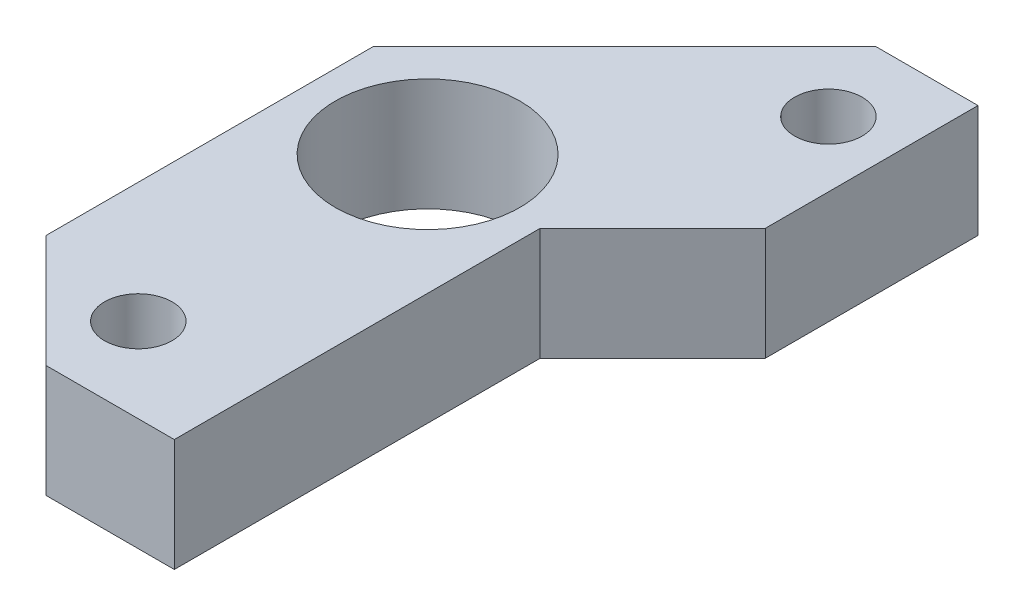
ISO-10303-21;
HEADER;
FILE_DESCRIPTION(('STEP AP214'),'2;1');
FILE_NAME('part.step','',(''),(''),'','','');
FILE_SCHEMA(('AUTOMOTIVE_DESIGN { 1 0 10303 214 1 1 1 1 }'));
ENDSEC;
DATA;
#1=APPLICATION_CONTEXT('core data for automotive mechanical design processes');
#2=APPLICATION_PROTOCOL_DEFINITION('international standard','automotive_design',2000,#1);
#3=PRODUCT_CONTEXT('',#1,'mechanical');
#4=PRODUCT('Part','Part','',(#3));
#5=PRODUCT_RELATED_PRODUCT_CATEGORY('part','',(#4));
#6=PRODUCT_DEFINITION_FORMATION('','',#4);
#7=PRODUCT_DEFINITION_CONTEXT('part definition',#1,'design');
#8=PRODUCT_DEFINITION('design','',#6,#7);
#9=PRODUCT_DEFINITION_SHAPE('','',#8);
#10=(LENGTH_UNIT() NAMED_UNIT(*) SI_UNIT(.MILLI.,.METRE.));
#11=(NAMED_UNIT(*) PLANE_ANGLE_UNIT() SI_UNIT($,.RADIAN.));
#12=(NAMED_UNIT(*) SI_UNIT($,.STERADIAN.) SOLID_ANGLE_UNIT());
#13=UNCERTAINTY_MEASURE_WITH_UNIT(LENGTH_MEASURE(1.E-05),#10,'distance_accuracy_value','');
#14=(GEOMETRIC_REPRESENTATION_CONTEXT(3) GLOBAL_UNCERTAINTY_ASSIGNED_CONTEXT((#13)) GLOBAL_UNIT_ASSIGNED_CONTEXT((#10,
#11,#12)) REPRESENTATION_CONTEXT('',''));
#15=CARTESIAN_POINT('',(0.,0.,0.));
#16=DIRECTION('',(0.,0.,1.));
#17=DIRECTION('',(1.,0.,0.));
#18=AXIS2_PLACEMENT_3D('',#15,#16,#17);
#19=CARTESIAN_POINT('',(0.,4.,0.));
#20=DIRECTION('',(0.,1.,0.));
#21=DIRECTION('',(0.,0.,1.));
#22=AXIS2_PLACEMENT_3D('',#19,#20,#21);
#23=PLANE('',#22);
#24=CARTESIAN_POINT('',(43.5,4.,10.28));
#25=DIRECTION('',(0.,1.,0.));
#26=DIRECTION('',(0.,0.,1.));
#27=AXIS2_PLACEMENT_3D('',#24,#25,#26);
#28=CIRCLE('',#27,1.2);
#29=CARTESIAN_POINT('',(43.5,4.,11.48));
#30=VERTEX_POINT('',#29);
#31=EDGE_CURVE('E182',#30,#30,#28,.T.);
#32=ORIENTED_EDGE('',*,*,#31,.F.);
#33=EDGE_LOOP('',(#32));
#34=FACE_BOUND('',#33,.T.);
#35=DIRECTION('',(0.,0.,-1.));
#36=VECTOR('',#35,1.);
#37=CARTESIAN_POINT('',(47.78,4.,0.280000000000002));
#38=LINE('',#37,#36);
#39=CARTESIAN_POINT('',(47.78,4.,13.28));
#40=VERTEX_POINT('',#39);
#41=CARTESIAN_POINT('',(47.78,4.,0.280000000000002));
#42=VERTEX_POINT('',#41);
#43=EDGE_CURVE('E145',#40,#42,#38,.T.);
#44=ORIENTED_EDGE('',*,*,#43,.T.);
#45=DIRECTION('',(0.707106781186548,0.,-0.707106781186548));
#46=VECTOR('',#45,1.);
#47=CARTESIAN_POINT('',(47.78,4.,0.280000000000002));
#48=LINE('',#47,#46);
#49=CARTESIAN_POINT('',(51.78,4.,-3.71999999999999));
#50=VERTEX_POINT('',#49);
#51=EDGE_CURVE('E93',#42,#50,#48,.T.);
#52=ORIENTED_EDGE('',*,*,#51,.T.);
#53=DIRECTION('',(0.,0.,-1.));
#54=VECTOR('',#53,1.);
#55=CARTESIAN_POINT('',(51.78,4.,-11.28));
#56=LINE('',#55,#54);
#57=CARTESIAN_POINT('',(51.78,4.,-11.28));
#58=VERTEX_POINT('',#57);
#59=EDGE_CURVE('E160',#50,#58,#56,.T.);
#60=ORIENTED_EDGE('',*,*,#59,.T.);
#61=DIRECTION('',(-1.,0.,0.));
#62=VECTOR('',#61,1.);
#63=CARTESIAN_POINT('',(48.1467711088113,4.,-11.28));
#64=LINE('',#63,#62);
#65=CARTESIAN_POINT('',(48.1467711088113,4.,-11.28));
#66=VERTEX_POINT('',#65);
#67=EDGE_CURVE('E173',#58,#66,#64,.T.);
#68=ORIENTED_EDGE('',*,*,#67,.T.);
#69=DIRECTION('',(-0.707106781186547,0.,0.707106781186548));
#70=VECTOR('',#69,1.);
#71=CARTESIAN_POINT('',(39.22,4.,-2.3532288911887));
#72=LINE('',#71,#70);
#73=CARTESIAN_POINT('',(39.22,4.,-2.3532288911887));
#74=VERTEX_POINT('',#73);
#75=EDGE_CURVE('E112',#66,#74,#72,.T.);
#76=ORIENTED_EDGE('',*,*,#75,.T.);
#77=DIRECTION('',(0.,0.,1.));
#78=VECTOR('',#77,1.);
#79=CARTESIAN_POINT('',(39.22,4.,9.28000000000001));
#80=LINE('',#79,#78);
#81=CARTESIAN_POINT('',(39.22,4.,9.28000000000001));
#82=VERTEX_POINT('',#81);
#83=EDGE_CURVE('E106',#74,#82,#80,.T.);
#84=ORIENTED_EDGE('',*,*,#83,.T.);
#85=DIRECTION('',(0.707106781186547,0.,0.707106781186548));
#86=VECTOR('',#85,1.);
#87=CARTESIAN_POINT('',(43.22,4.,13.28));
#88=LINE('',#87,#86);
#89=CARTESIAN_POINT('',(43.22,4.,13.28));
#90=VERTEX_POINT('',#89);
#91=EDGE_CURVE('E110',#82,#90,#88,.T.);
#92=ORIENTED_EDGE('',*,*,#91,.T.);
#93=DIRECTION('',(1.,0.,0.));
#94=VECTOR('',#93,1.);
#95=CARTESIAN_POINT('',(43.22,4.,13.28));
#96=LINE('',#95,#94);
#97=EDGE_CURVE('E50',#90,#40,#96,.T.);
#98=ORIENTED_EDGE('',*,*,#97,.T.);
#99=EDGE_LOOP('',(#44,#52,#60,#68,#76,#84,#92,#98));
#100=FACE_BOUND('',#99,.T.);
#101=CARTESIAN_POINT('',(43.5,4.,0.));
#102=DIRECTION('',(0.,1.,0.));
#103=DIRECTION('',(0.,0.,1.));
#104=AXIS2_PLACEMENT_3D('',#101,#102,#103);
#105=CIRCLE('',#104,3.28000000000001);
#106=CARTESIAN_POINT('',(43.5,4.,3.28));
#107=VERTEX_POINT('',#106);
#108=EDGE_CURVE('E134',#107,#107,#105,.T.);
#109=ORIENTED_EDGE('',*,*,#108,.F.);
#110=EDGE_LOOP('',(#109));
#111=FACE_BOUND('',#110,.T.);
#112=CARTESIAN_POINT('',(49.4633855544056,4.,-8.28000000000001));
#113=DIRECTION('',(0.,1.,0.));
#114=DIRECTION('',(0.,0.,1.));
#115=AXIS2_PLACEMENT_3D('',#112,#113,#114);
#116=CIRCLE('',#115,1.2);
#117=CARTESIAN_POINT('',(49.4633855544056,4.,-7.08000000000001));
#118=VERTEX_POINT('',#117);
#119=EDGE_CURVE('E188',#118,#118,#116,.T.);
#120=ORIENTED_EDGE('',*,*,#119,.F.);
#121=EDGE_LOOP('',(#120));
#122=FACE_BOUND('',#121,.T.);
#123=ADVANCED_FACE('F33',(#34,#100,#111,#122),#23,.T.);
#124=CARTESIAN_POINT('',(0.,0.,0.));
#125=DIRECTION('',(0.,1.,0.));
#126=DIRECTION('',(0.,0.,1.));
#127=AXIS2_PLACEMENT_3D('',#124,#125,#126);
#128=PLANE('',#127);
#129=CARTESIAN_POINT('',(43.5,0.,10.28));
#130=DIRECTION('',(0.,1.,0.));
#131=DIRECTION('',(0.,0.,1.));
#132=AXIS2_PLACEMENT_3D('',#129,#130,#131);
#133=CIRCLE('',#132,1.2);
#134=CARTESIAN_POINT('',(43.5,0.,11.48));
#135=VERTEX_POINT('',#134);
#136=EDGE_CURVE('E185',#135,#135,#133,.T.);
#137=ORIENTED_EDGE('',*,*,#136,.T.);
#138=EDGE_LOOP('',(#137));
#139=FACE_BOUND('',#138,.T.);
#140=DIRECTION('',(0.,0.,-1.));
#141=VECTOR('',#140,1.);
#142=CARTESIAN_POINT('',(47.78,0.,0.280000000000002));
#143=LINE('',#142,#141);
#144=CARTESIAN_POINT('',(47.78,0.,13.28));
#145=VERTEX_POINT('',#144);
#146=CARTESIAN_POINT('',(47.78,0.,0.280000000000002));
#147=VERTEX_POINT('',#146);
#148=EDGE_CURVE('E130',#145,#147,#143,.T.);
#149=ORIENTED_EDGE('',*,*,#148,.F.);
#150=DIRECTION('',(1.,0.,0.));
#151=VECTOR('',#150,1.);
#152=CARTESIAN_POINT('',(43.22,0.,13.28));
#153=LINE('',#152,#151);
#154=CARTESIAN_POINT('',(43.22,0.,13.28));
#155=VERTEX_POINT('',#154);
#156=EDGE_CURVE('E85',#155,#145,#153,.T.);
#157=ORIENTED_EDGE('',*,*,#156,.F.);
#158=DIRECTION('',(0.707106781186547,0.,0.707106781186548));
#159=VECTOR('',#158,1.);
#160=CARTESIAN_POINT('',(43.22,0.,13.28));
#161=LINE('',#160,#159);
#162=CARTESIAN_POINT('',(39.22,0.,9.28000000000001));
#163=VERTEX_POINT('',#162);
#164=EDGE_CURVE('E79',#163,#155,#161,.T.);
#165=ORIENTED_EDGE('',*,*,#164,.F.);
#166=DIRECTION('',(0.,0.,1.));
#167=VECTOR('',#166,1.);
#168=CARTESIAN_POINT('',(39.22,0.,9.28000000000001));
#169=LINE('',#168,#167);
#170=CARTESIAN_POINT('',(39.22,0.,-2.3532288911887));
#171=VERTEX_POINT('',#170);
#172=EDGE_CURVE('E120',#171,#163,#169,.T.);
#173=ORIENTED_EDGE('',*,*,#172,.F.);
#174=DIRECTION('',(-0.707106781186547,0.,0.707106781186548));
#175=VECTOR('',#174,1.);
#176=CARTESIAN_POINT('',(39.22,0.,-2.3532288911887));
#177=LINE('',#176,#175);
#178=CARTESIAN_POINT('',(48.1467711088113,0.,-11.28));
#179=VERTEX_POINT('',#178);
#180=EDGE_CURVE('E140',#179,#171,#177,.T.);
#181=ORIENTED_EDGE('',*,*,#180,.F.);
#182=DIRECTION('',(-1.,0.,0.));
#183=VECTOR('',#182,1.);
#184=CARTESIAN_POINT('',(48.1467711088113,0.,-11.28));
#185=LINE('',#184,#183);
#186=CARTESIAN_POINT('',(51.78,0.,-11.28));
#187=VERTEX_POINT('',#186);
#188=EDGE_CURVE('E138',#187,#179,#185,.T.);
#189=ORIENTED_EDGE('',*,*,#188,.F.);
#190=DIRECTION('',(0.,0.,-1.));
#191=VECTOR('',#190,1.);
#192=CARTESIAN_POINT('',(51.78,0.,-11.28));
#193=LINE('',#192,#191);
#194=CARTESIAN_POINT('',(51.78,0.,-3.71999999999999));
#195=VERTEX_POINT('',#194);
#196=EDGE_CURVE('E136',#195,#187,#193,.T.);
#197=ORIENTED_EDGE('',*,*,#196,.F.);
#198=DIRECTION('',(0.707106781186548,0.,-0.707106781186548));
#199=VECTOR('',#198,1.);
#200=CARTESIAN_POINT('',(47.78,0.,0.280000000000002));
#201=LINE('',#200,#199);
#202=EDGE_CURVE('E133',#147,#195,#201,.T.);
#203=ORIENTED_EDGE('',*,*,#202,.F.);
#204=EDGE_LOOP('',(#149,#157,#165,#173,#181,#189,#197,#203));
#205=FACE_BOUND('',#204,.T.);
#206=CARTESIAN_POINT('',(43.5,0.,0.));
#207=DIRECTION('',(0.,1.,0.));
#208=DIRECTION('',(0.,0.,1.));
#209=AXIS2_PLACEMENT_3D('',#206,#207,#208);
#210=CIRCLE('',#209,3.28000000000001);
#211=CARTESIAN_POINT('',(43.5,0.,3.28));
#212=VERTEX_POINT('',#211);
#213=EDGE_CURVE('E179',#212,#212,#210,.T.);
#214=ORIENTED_EDGE('',*,*,#213,.T.);
#215=EDGE_LOOP('',(#214));
#216=FACE_BOUND('',#215,.T.);
#217=CARTESIAN_POINT('',(49.4633855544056,0.,-8.28000000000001));
#218=DIRECTION('',(0.,1.,0.));
#219=DIRECTION('',(0.,0.,1.));
#220=AXIS2_PLACEMENT_3D('',#217,#218,#219);
#221=CIRCLE('',#220,1.2);
#222=CARTESIAN_POINT('',(49.4633855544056,0.,-7.08000000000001));
#223=VERTEX_POINT('',#222);
#224=EDGE_CURVE('E191',#223,#223,#221,.T.);
#225=ORIENTED_EDGE('',*,*,#224,.T.);
#226=EDGE_LOOP('',(#225));
#227=FACE_BOUND('',#226,.T.);
#228=ADVANCED_FACE('F164',(#139,#205,#216,#227),#128,.F.);
#229=CARTESIAN_POINT('',(47.78,4.,0.280000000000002));
#230=DIRECTION('',(-1.,0.,0.));
#231=DIRECTION('',(0.,0.,1.));
#232=AXIS2_PLACEMENT_3D('',#229,#230,#231);
#233=PLANE('',#232);
#234=ORIENTED_EDGE('',*,*,#148,.T.);
#235=DIRECTION('',(0.,-1.,0.));
#236=VECTOR('',#235,1.);
#237=CARTESIAN_POINT('',(47.78,4.,0.280000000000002));
#238=LINE('',#237,#236);
#239=EDGE_CURVE('E11',#42,#147,#238,.T.);
#240=ORIENTED_EDGE('',*,*,#239,.F.);
#241=ORIENTED_EDGE('',*,*,#43,.F.);
#242=DIRECTION('',(0.,-1.,0.));
#243=VECTOR('',#242,1.);
#244=CARTESIAN_POINT('',(47.78,4.,13.28));
#245=LINE('',#244,#243);
#246=EDGE_CURVE('E126',#40,#145,#245,.T.);
#247=ORIENTED_EDGE('',*,*,#246,.T.);
#248=EDGE_LOOP('',(#234,#240,#241,#247));
#249=FACE_BOUND('',#248,.T.);
#250=ADVANCED_FACE('F35',(#249),#233,.F.);
#251=CARTESIAN_POINT('',(47.78,4.,0.280000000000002));
#252=DIRECTION('',(-0.707106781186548,0.,-0.707106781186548));
#253=DIRECTION('',(-0.707106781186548,0.,0.707106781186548));
#254=AXIS2_PLACEMENT_3D('',#251,#252,#253);
#255=PLANE('',#254);
#256=ORIENTED_EDGE('',*,*,#202,.T.);
#257=DIRECTION('',(0.,-1.,0.));
#258=VECTOR('',#257,1.);
#259=CARTESIAN_POINT('',(51.78,4.,-3.71999999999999));
#260=LINE('',#259,#258);
#261=EDGE_CURVE('E42',#50,#195,#260,.T.);
#262=ORIENTED_EDGE('',*,*,#261,.F.);
#263=ORIENTED_EDGE('',*,*,#51,.F.);
#264=ORIENTED_EDGE('',*,*,#239,.T.);
#265=EDGE_LOOP('',(#256,#262,#263,#264));
#266=FACE_BOUND('',#265,.T.);
#267=ADVANCED_FACE('F225',(#266),#255,.F.);
#268=CARTESIAN_POINT('',(51.78,4.,-11.28));
#269=DIRECTION('',(-1.,0.,0.));
#270=DIRECTION('',(0.,0.,1.));
#271=AXIS2_PLACEMENT_3D('',#268,#269,#270);
#272=PLANE('',#271);
#273=ORIENTED_EDGE('',*,*,#196,.T.);
#274=DIRECTION('',(0.,-1.,0.));
#275=VECTOR('',#274,1.);
#276=CARTESIAN_POINT('',(51.78,4.,-11.28));
#277=LINE('',#276,#275);
#278=EDGE_CURVE('E152',#58,#187,#277,.T.);
#279=ORIENTED_EDGE('',*,*,#278,.F.);
#280=ORIENTED_EDGE('',*,*,#59,.F.);
#281=ORIENTED_EDGE('',*,*,#261,.T.);
#282=EDGE_LOOP('',(#273,#279,#280,#281));
#283=FACE_BOUND('',#282,.T.);
#284=ADVANCED_FACE('F158',(#283),#272,.F.);
#285=CARTESIAN_POINT('',(48.1467711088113,4.,-11.28));
#286=DIRECTION('',(0.,0.,1.));
#287=DIRECTION('',(1.,0.,0.));
#288=AXIS2_PLACEMENT_3D('',#285,#286,#287);
#289=PLANE('',#288);
#290=ORIENTED_EDGE('',*,*,#188,.T.);
#291=DIRECTION('',(0.,-1.,0.));
#292=VECTOR('',#291,1.);
#293=CARTESIAN_POINT('',(48.1467711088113,4.,-11.28));
#294=LINE('',#293,#292);
#295=EDGE_CURVE('E149',#66,#179,#294,.T.);
#296=ORIENTED_EDGE('',*,*,#295,.F.);
#297=ORIENTED_EDGE('',*,*,#67,.F.);
#298=ORIENTED_EDGE('',*,*,#278,.T.);
#299=EDGE_LOOP('',(#290,#296,#297,#298));
#300=FACE_BOUND('',#299,.T.);
#301=ADVANCED_FACE('F169',(#300),#289,.F.);
#302=CARTESIAN_POINT('',(39.22,4.,-2.3532288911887));
#303=DIRECTION('',(0.707106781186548,0.,0.707106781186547));
#304=DIRECTION('',(0.707106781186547,0.,-0.707106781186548));
#305=AXIS2_PLACEMENT_3D('',#302,#303,#304);
#306=PLANE('',#305);
#307=ORIENTED_EDGE('',*,*,#180,.T.);
#308=DIRECTION('',(0.,-1.,0.));
#309=VECTOR('',#308,1.);
#310=CARTESIAN_POINT('',(39.22,4.,-2.3532288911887));
#311=LINE('',#310,#309);
#312=EDGE_CURVE('E121',#74,#171,#311,.T.);
#313=ORIENTED_EDGE('',*,*,#312,.F.);
#314=ORIENTED_EDGE('',*,*,#75,.F.);
#315=ORIENTED_EDGE('',*,*,#295,.T.);
#316=EDGE_LOOP('',(#307,#313,#314,#315));
#317=FACE_BOUND('',#316,.T.);
#318=ADVANCED_FACE('F172',(#317),#306,.F.);
#319=CARTESIAN_POINT('',(39.22,4.,9.28000000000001));
#320=DIRECTION('',(1.,0.,0.));
#321=DIRECTION('',(0.,0.,-1.));
#322=AXIS2_PLACEMENT_3D('',#319,#320,#321);
#323=PLANE('',#322);
#324=ORIENTED_EDGE('',*,*,#172,.T.);
#325=DIRECTION('',(0.,-1.,0.));
#326=VECTOR('',#325,1.);
#327=CARTESIAN_POINT('',(39.22,4.,9.28000000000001));
#328=LINE('',#327,#326);
#329=EDGE_CURVE('E117',#82,#163,#328,.T.);
#330=ORIENTED_EDGE('',*,*,#329,.F.);
#331=ORIENTED_EDGE('',*,*,#83,.F.);
#332=ORIENTED_EDGE('',*,*,#312,.T.);
#333=EDGE_LOOP('',(#324,#330,#331,#332));
#334=FACE_BOUND('',#333,.T.);
#335=ADVANCED_FACE('F118',(#334),#323,.F.);
#336=CARTESIAN_POINT('',(43.22,4.,13.28));
#337=DIRECTION('',(0.707106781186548,0.,-0.707106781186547));
#338=DIRECTION('',(-0.707106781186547,0.,-0.707106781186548));
#339=AXIS2_PLACEMENT_3D('',#336,#337,#338);
#340=PLANE('',#339);
#341=ORIENTED_EDGE('',*,*,#164,.T.);
#342=DIRECTION('',(0.,-1.,0.));
#343=VECTOR('',#342,1.);
#344=CARTESIAN_POINT('',(43.22,4.,13.28));
#345=LINE('',#344,#343);
#346=EDGE_CURVE('E122',#90,#155,#345,.T.);
#347=ORIENTED_EDGE('',*,*,#346,.F.);
#348=ORIENTED_EDGE('',*,*,#91,.F.);
#349=ORIENTED_EDGE('',*,*,#329,.T.);
#350=EDGE_LOOP('',(#341,#347,#348,#349));
#351=FACE_BOUND('',#350,.T.);
#352=ADVANCED_FACE('F124',(#351),#340,.F.);
#353=CARTESIAN_POINT('',(43.22,4.,13.28));
#354=DIRECTION('',(0.,0.,-1.));
#355=DIRECTION('',(-1.,0.,0.));
#356=AXIS2_PLACEMENT_3D('',#353,#354,#355);
#357=PLANE('',#356);
#358=ORIENTED_EDGE('',*,*,#156,.T.);
#359=ORIENTED_EDGE('',*,*,#246,.F.);
#360=ORIENTED_EDGE('',*,*,#97,.F.);
#361=ORIENTED_EDGE('',*,*,#346,.T.);
#362=EDGE_LOOP('',(#358,#359,#360,#361));
#363=FACE_BOUND('',#362,.T.);
#364=ADVANCED_FACE('F213',(#363),#357,.F.);
#365=CARTESIAN_POINT('',(43.5,4.,0.));
#366=DIRECTION('',(0.,-1.,0.));
#367=DIRECTION('',(0.,0.,-1.));
#368=AXIS2_PLACEMENT_3D('',#365,#366,#367);
#369=CYLINDRICAL_SURFACE('',#368,3.28000000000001);
#370=ORIENTED_EDGE('',*,*,#108,.T.);
#371=EDGE_LOOP('',(#370));
#372=FACE_BOUND('',#371,.T.);
#373=ORIENTED_EDGE('',*,*,#213,.F.);
#374=EDGE_LOOP('',(#373));
#375=FACE_BOUND('',#374,.T.);
#376=ADVANCED_FACE('F210',(#372,#375),#369,.F.);
#377=CARTESIAN_POINT('',(43.5,4.,10.28));
#378=DIRECTION('',(0.,-1.,0.));
#379=DIRECTION('',(0.,0.,-1.));
#380=AXIS2_PLACEMENT_3D('',#377,#378,#379);
#381=CYLINDRICAL_SURFACE('',#380,1.2);
#382=ORIENTED_EDGE('',*,*,#31,.T.);
#383=EDGE_LOOP('',(#382));
#384=FACE_BOUND('',#383,.T.);
#385=ORIENTED_EDGE('',*,*,#136,.F.);
#386=EDGE_LOOP('',(#385));
#387=FACE_BOUND('',#386,.T.);
#388=ADVANCED_FACE('F289',(#384,#387),#381,.F.);
#389=CARTESIAN_POINT('',(49.4633855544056,4.,-8.28000000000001));
#390=DIRECTION('',(0.,-1.,0.));
#391=DIRECTION('',(0.,0.,-1.));
#392=AXIS2_PLACEMENT_3D('',#389,#390,#391);
#393=CYLINDRICAL_SURFACE('',#392,1.2);
#394=ORIENTED_EDGE('',*,*,#119,.T.);
#395=EDGE_LOOP('',(#394));
#396=FACE_BOUND('',#395,.T.);
#397=ORIENTED_EDGE('',*,*,#224,.F.);
#398=EDGE_LOOP('',(#397));
#399=FACE_BOUND('',#398,.T.);
#400=ADVANCED_FACE('F197',(#396,#399),#393,.F.);
#401=CLOSED_SHELL('',(#123,#228,#250,#267,#284,#301,#318,#335,#352,#364,#376,#388,#400));
#402=MANIFOLD_SOLID_BREP('B2',#401);
#403=ADVANCED_BREP_SHAPE_REPRESENTATION('',(#18,#402),#14);
#404=SHAPE_DEFINITION_REPRESENTATION(#9,#403);
ENDSEC;
END-ISO-10303-21;
